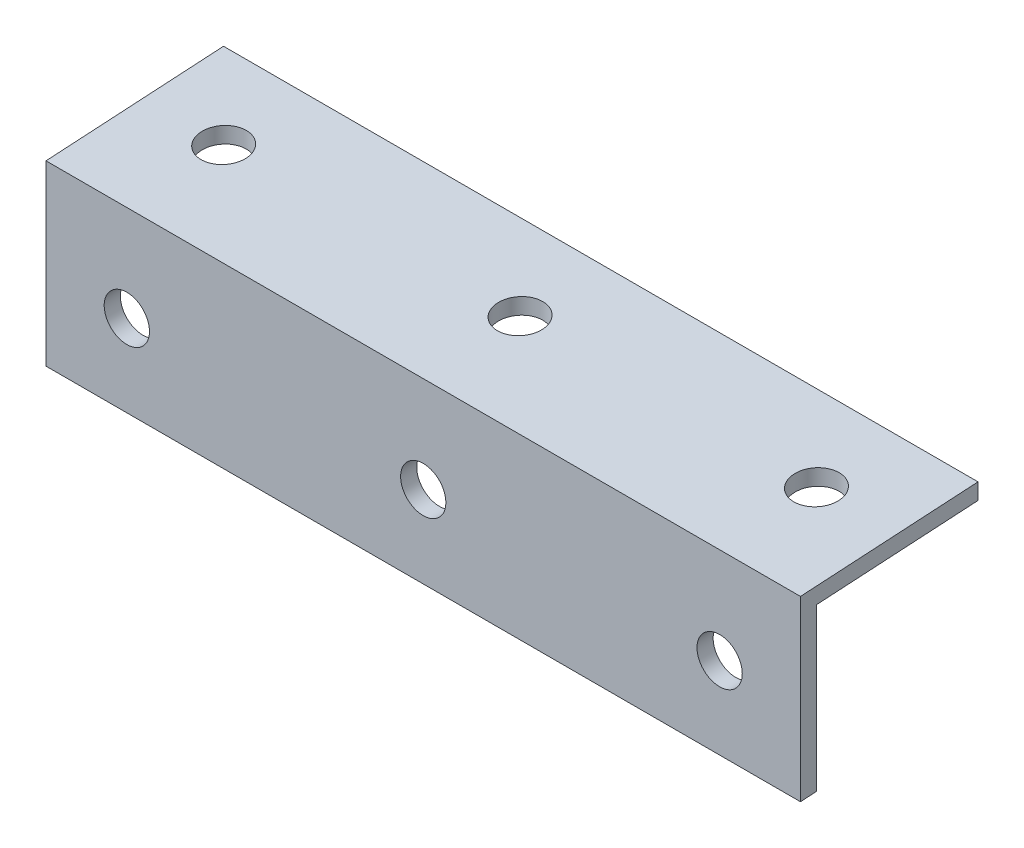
ISO-10303-21;
HEADER;
FILE_DESCRIPTION(('STEP AP214'),'2;1');
FILE_NAME('part.step','',(''),(''),'','','');
FILE_SCHEMA(('AUTOMOTIVE_DESIGN { 1 0 10303 214 1 1 1 1 }'));
ENDSEC;
DATA;
#1=APPLICATION_CONTEXT('core data for automotive mechanical design processes');
#2=APPLICATION_PROTOCOL_DEFINITION('international standard','automotive_design',2000,#1);
#3=PRODUCT_CONTEXT('',#1,'mechanical');
#4=PRODUCT('Part','Part','',(#3));
#5=PRODUCT_RELATED_PRODUCT_CATEGORY('part','',(#4));
#6=PRODUCT_DEFINITION_FORMATION('','',#4);
#7=PRODUCT_DEFINITION_CONTEXT('part definition',#1,'design');
#8=PRODUCT_DEFINITION('design','',#6,#7);
#9=PRODUCT_DEFINITION_SHAPE('','',#8);
#10=(LENGTH_UNIT() NAMED_UNIT(*) SI_UNIT(.MILLI.,.METRE.));
#11=(NAMED_UNIT(*) PLANE_ANGLE_UNIT() SI_UNIT($,.RADIAN.));
#12=(NAMED_UNIT(*) SI_UNIT($,.STERADIAN.) SOLID_ANGLE_UNIT());
#13=UNCERTAINTY_MEASURE_WITH_UNIT(LENGTH_MEASURE(1.E-05),#10,'distance_accuracy_value','');
#14=(GEOMETRIC_REPRESENTATION_CONTEXT(3) GLOBAL_UNCERTAINTY_ASSIGNED_CONTEXT((#13)) GLOBAL_UNIT_ASSIGNED_CONTEXT((#10,
#11,#12)) REPRESENTATION_CONTEXT('',''));
#15=CARTESIAN_POINT('',(0.,0.,0.));
#16=DIRECTION('',(0.,0.,1.));
#17=DIRECTION('',(1.,0.,0.));
#18=AXIS2_PLACEMENT_3D('',#15,#16,#17);
#19=CARTESIAN_POINT('',(88.9000000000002,-19.1620588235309,1.90170129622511));
#20=DIRECTION('',(0.,0.998268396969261,0.0588235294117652));
#21=DIRECTION('',(0.,-0.0588235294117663,0.998268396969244));
#22=AXIS2_PLACEMENT_3D('',#19,#20,#21);
#23=PLANE('',#22);
#24=DIRECTION('',(0.,0.0588235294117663,-0.998268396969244));
#25=VECTOR('',#24,1.);
#26=CARTESIAN_POINT('',(8.88178419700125E-13,-19.1620588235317,1.90170129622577));
#27=LINE('',#26,#25);
#28=CARTESIAN_POINT('',(8.88178419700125E-13,-19.1620588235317,1.90170129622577));
#29=VERTEX_POINT('',#28);
#30=CARTESIAN_POINT('',(4.44089209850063E-13,-19.0500000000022,-8.60422844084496E-13));
#31=VERTEX_POINT('',#30);
#32=EDGE_CURVE('E137',#29,#31,#27,.T.);
#33=ORIENTED_EDGE('',*,*,#32,.T.);
#34=DIRECTION('',(-1.00000000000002,0.,0.));
#35=VECTOR('',#34,1.);
#36=CARTESIAN_POINT('',(88.9,-19.050000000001,-8.32667268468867E-13));
#37=LINE('',#36,#35);
#38=CARTESIAN_POINT('',(88.9,-19.050000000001,-8.32667268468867E-13));
#39=VERTEX_POINT('',#38);
#40=EDGE_CURVE('E11',#39,#31,#37,.T.);
#41=ORIENTED_EDGE('',*,*,#40,.F.);
#42=DIRECTION('',(0.,0.0588235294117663,-0.998268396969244));
#43=VECTOR('',#42,1.);
#44=CARTESIAN_POINT('',(88.9000000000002,-19.1620588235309,1.90170129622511));
#45=LINE('',#44,#43);
#46=CARTESIAN_POINT('',(88.9000000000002,-19.1620588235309,1.90170129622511));
#47=VERTEX_POINT('',#46);
#48=EDGE_CURVE('E156',#47,#39,#45,.T.);
#49=ORIENTED_EDGE('',*,*,#48,.F.);
#50=DIRECTION('',(-1.00000000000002,0.,0.));
#51=VECTOR('',#50,1.);
#52=CARTESIAN_POINT('',(88.9000000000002,-19.1620588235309,1.90170129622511));
#53=LINE('',#52,#51);
#54=EDGE_CURVE('E132',#47,#29,#53,.T.);
#55=ORIENTED_EDGE('',*,*,#54,.T.);
#56=EDGE_LOOP('',(#33,#41,#49,#55));
#57=FACE_BOUND('',#56,.T.);
#58=ADVANCED_FACE('F50',(#57),#23,.F.);
#59=CARTESIAN_POINT('',(88.9,-19.050000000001,-8.32667268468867E-13));
#60=DIRECTION('',(0.,0.,1.));
#61=DIRECTION('',(1.00000000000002,0.,0.));
#62=AXIS2_PLACEMENT_3D('',#59,#60,#61);
#63=PLANE('',#62);
#64=CARTESIAN_POINT('',(9.52499999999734,-9.52500000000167,-3.33066907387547E-13));
#65=DIRECTION('',(0.,0.,1.));
#66=DIRECTION('',(1.00000000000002,0.,0.));
#67=AXIS2_PLACEMENT_3D('',#64,#65,#66);
#68=CIRCLE('',#67,2.667);
#69=CARTESIAN_POINT('',(12.1919999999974,-9.52500000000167,-3.33103590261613E-13));
#70=VERTEX_POINT('',#69);
#71=EDGE_CURVE('E145',#70,#70,#68,.T.);
#72=ORIENTED_EDGE('',*,*,#71,.T.);
#73=EDGE_LOOP('',(#72));
#74=FACE_BOUND('',#73,.T.);
#75=CARTESIAN_POINT('',(44.4499999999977,-9.52500000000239,-2.02615701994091E-12));
#76=DIRECTION('',(0.,0.,1.));
#77=DIRECTION('',(1.00000000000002,0.,0.));
#78=AXIS2_PLACEMENT_3D('',#75,#76,#77);
#79=CIRCLE('',#78,2.667);
#80=CARTESIAN_POINT('',(47.1169999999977,-9.52500000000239,-2.02619370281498E-12));
#81=VERTEX_POINT('',#80);
#82=EDGE_CURVE('E210',#81,#81,#79,.T.);
#83=ORIENTED_EDGE('',*,*,#82,.T.);
#84=EDGE_LOOP('',(#83));
#85=FACE_BOUND('',#84,.T.);
#86=CARTESIAN_POINT('',(79.3749999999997,-9.52500000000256,-6.93889390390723E-13));
#87=DIRECTION('',(0.,0.,1.));
#88=DIRECTION('',(1.00000000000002,0.,0.));
#89=AXIS2_PLACEMENT_3D('',#86,#87,#88);
#90=CIRCLE('',#89,2.667);
#91=CARTESIAN_POINT('',(82.0419999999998,-9.52500000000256,-6.93926073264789E-13));
#92=VERTEX_POINT('',#91);
#93=EDGE_CURVE('E198',#92,#92,#90,.T.);
#94=ORIENTED_EDGE('',*,*,#93,.T.);
#95=EDGE_LOOP('',(#94));
#96=FACE_BOUND('',#95,.T.);
#97=DIRECTION('',(0.,1.00000000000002,0.));
#98=VECTOR('',#97,1.);
#99=CARTESIAN_POINT('',(4.44089209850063E-13,-19.0500000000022,-8.60422844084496E-13));
#100=LINE('',#99,#98);
#101=CARTESIAN_POINT('',(0.,0.,0.));
#102=VERTEX_POINT('',#101);
#103=EDGE_CURVE('E141',#31,#102,#100,.T.);
#104=ORIENTED_EDGE('',*,*,#103,.T.);
#105=DIRECTION('',(-1.00000000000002,0.,0.));
#106=VECTOR('',#105,1.);
#107=CARTESIAN_POINT('',(88.9000000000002,-1.4432899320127E-12,-1.22124532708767E-12));
#108=LINE('',#107,#106);
#109=CARTESIAN_POINT('',(88.9000000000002,-1.4432899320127E-12,-1.22124532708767E-12));
#110=VERTEX_POINT('',#109);
#111=EDGE_CURVE('E60',#110,#102,#108,.T.);
#112=ORIENTED_EDGE('',*,*,#111,.F.);
#113=DIRECTION('',(0.,1.00000000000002,0.));
#114=VECTOR('',#113,1.);
#115=CARTESIAN_POINT('',(88.9,-19.050000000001,-8.32667268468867E-13));
#116=LINE('',#115,#114);
#117=EDGE_CURVE('E103',#39,#110,#116,.T.);
#118=ORIENTED_EDGE('',*,*,#117,.F.);
#119=ORIENTED_EDGE('',*,*,#40,.T.);
#120=EDGE_LOOP('',(#104,#112,#118,#119));
#121=FACE_BOUND('',#120,.T.);
#122=ADVANCED_FACE('F273',(#74,#85,#96,#121),#63,.F.);
#123=CARTESIAN_POINT('',(88.9000000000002,-1.4432899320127E-12,-1.22124532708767E-12));
#124=DIRECTION('',(0.,0.998268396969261,0.0588235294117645));
#125=DIRECTION('',(0.,-0.0588235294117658,0.998268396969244));
#126=AXIS2_PLACEMENT_3D('',#123,#124,#125);
#127=PLANE('',#126);
#128=CARTESIAN_POINT('',(9.52499999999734,0.560294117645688,-9.50850648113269));
#129=DIRECTION('',(0.,0.998268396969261,0.0588235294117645));
#130=DIRECTION('',(0.,0.0588235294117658,-0.998268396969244));
#131=AXIS2_PLACEMENT_3D('',#128,#129,#130);
#132=ELLIPSE('',#131,2.67162619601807,2.667);
#133=CARTESIAN_POINT('',(9.52499999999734,0.717448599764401,-12.1755064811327));
#134=VERTEX_POINT('',#133);
#135=EDGE_CURVE('E186',#134,#134,#132,.T.);
#136=ORIENTED_EDGE('',*,*,#135,.T.);
#137=EDGE_LOOP('',(#136));
#138=FACE_BOUND('',#137,.T.);
#139=CARTESIAN_POINT('',(44.4499999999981,0.560294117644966,-9.50850648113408));
#140=DIRECTION('',(0.,0.998268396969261,0.0588235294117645));
#141=DIRECTION('',(0.,0.0588235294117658,-0.998268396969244));
#142=AXIS2_PLACEMENT_3D('',#139,#140,#141);
#143=ELLIPSE('',#142,2.67162619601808,2.667);
#144=CARTESIAN_POINT('',(44.4499999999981,0.717448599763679,-12.1755064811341));
#145=VERTEX_POINT('',#144);
#146=EDGE_CURVE('E175',#145,#145,#143,.T.);
#147=ORIENTED_EDGE('',*,*,#146,.T.);
#148=EDGE_LOOP('',(#147));
#149=FACE_BOUND('',#148,.T.);
#150=CARTESIAN_POINT('',(79.375,0.560294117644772,-9.50850648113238));
#151=DIRECTION('',(0.,0.998268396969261,0.0588235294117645));
#152=DIRECTION('',(0.,0.0588235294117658,-0.998268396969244));
#153=AXIS2_PLACEMENT_3D('',#150,#151,#152);
#154=ELLIPSE('',#153,2.67162619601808,2.667);
#155=CARTESIAN_POINT('',(79.375,0.717448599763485,-12.1755064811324));
#156=VERTEX_POINT('',#155);
#157=EDGE_CURVE('E166',#156,#156,#154,.T.);
#158=ORIENTED_EDGE('',*,*,#157,.T.);
#159=EDGE_LOOP('',(#158));
#160=FACE_BOUND('',#159,.T.);
#161=DIRECTION('',(0.,0.0588235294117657,-0.998268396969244));
#162=VECTOR('',#161,1.);
#163=CARTESIAN_POINT('',(0.,0.,0.));
#164=LINE('',#163,#162);
#165=CARTESIAN_POINT('',(-1.55431223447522E-12,1.12058823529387,-19.0170129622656));
#166=VERTEX_POINT('',#165);
#167=EDGE_CURVE('E150',#102,#166,#164,.T.);
#168=ORIENTED_EDGE('',*,*,#167,.T.);
#169=DIRECTION('',(-1.00000000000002,0.,0.));
#170=VECTOR('',#169,1.);
#171=CARTESIAN_POINT('',(88.9,1.12058823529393,-19.0170129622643));
#172=LINE('',#171,#170);
#173=CARTESIAN_POINT('',(88.9,1.12058823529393,-19.0170129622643));
#174=VERTEX_POINT('',#173);
#175=EDGE_CURVE('E130',#174,#166,#172,.T.);
#176=ORIENTED_EDGE('',*,*,#175,.F.);
#177=DIRECTION('',(0.,0.0588235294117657,-0.998268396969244));
#178=VECTOR('',#177,1.);
#179=CARTESIAN_POINT('',(88.9000000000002,-1.4432899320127E-12,-1.22124532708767E-12));
#180=LINE('',#179,#178);
#181=EDGE_CURVE('E119',#110,#174,#180,.T.);
#182=ORIENTED_EDGE('',*,*,#181,.F.);
#183=ORIENTED_EDGE('',*,*,#111,.T.);
#184=EDGE_LOOP('',(#168,#176,#182,#183));
#185=FACE_BOUND('',#184,.T.);
#186=ADVANCED_FACE('F271',(#138,#149,#160,#185),#127,.F.);
#187=CARTESIAN_POINT('',(88.9,1.12058823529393,-19.0170129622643));
#188=DIRECTION('',(0.,0.,1.));
#189=DIRECTION('',(1.00000000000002,0.,0.));
#190=AXIS2_PLACEMENT_3D('',#187,#188,#189);
#191=PLANE('',#190);
#192=DIRECTION('',(0.,1.00000000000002,0.));
#193=VECTOR('',#192,1.);
#194=CARTESIAN_POINT('',(-1.55431223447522E-12,1.12058823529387,-19.0170129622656));
#195=LINE('',#194,#193);
#196=CARTESIAN_POINT('',(1.11022302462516E-12,3.02558823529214,-19.017012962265));
#197=VERTEX_POINT('',#196);
#198=EDGE_CURVE('E124',#166,#197,#195,.T.);
#199=ORIENTED_EDGE('',*,*,#198,.T.);
#200=DIRECTION('',(-1.00000000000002,0.,0.));
#201=VECTOR('',#200,1.);
#202=CARTESIAN_POINT('',(88.9000000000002,3.02558823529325,-19.0170129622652));
#203=LINE('',#202,#201);
#204=CARTESIAN_POINT('',(88.9000000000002,3.02558823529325,-19.0170129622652));
#205=VERTEX_POINT('',#204);
#206=EDGE_CURVE('E125',#205,#197,#203,.T.);
#207=ORIENTED_EDGE('',*,*,#206,.F.);
#208=DIRECTION('',(0.,1.00000000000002,0.));
#209=VECTOR('',#208,1.);
#210=CARTESIAN_POINT('',(88.9,1.12058823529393,-19.0170129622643));
#211=LINE('',#210,#209);
#212=EDGE_CURVE('E109',#174,#205,#211,.T.);
#213=ORIENTED_EDGE('',*,*,#212,.F.);
#214=ORIENTED_EDGE('',*,*,#175,.T.);
#215=EDGE_LOOP('',(#199,#207,#213,#214));
#216=FACE_BOUND('',#215,.T.);
#217=ADVANCED_FACE('F123',(#216),#191,.F.);
#218=CARTESIAN_POINT('',(88.9000000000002,3.02558823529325,-19.0170129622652));
#219=DIRECTION('',(0.,-0.998268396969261,-0.0588235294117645));
#220=DIRECTION('',(0.,0.0588235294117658,-0.998268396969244));
#221=AXIS2_PLACEMENT_3D('',#218,#219,#220);
#222=PLANE('',#221);
#223=CARTESIAN_POINT('',(9.52499999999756,2.46529411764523,-9.50850648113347));
#224=DIRECTION('',(0.,-0.998268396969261,-0.0588235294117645));
#225=DIRECTION('',(0.,0.0588235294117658,-0.998268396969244));
#226=AXIS2_PLACEMENT_3D('',#223,#224,#225);
#227=ELLIPSE('',#226,2.67162619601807,2.667);
#228=CARTESIAN_POINT('',(9.52499999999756,2.62244859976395,-12.1755064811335));
#229=VERTEX_POINT('',#228);
#230=EDGE_CURVE('E49',#229,#229,#227,.T.);
#231=ORIENTED_EDGE('',*,*,#230,.T.);
#232=EDGE_LOOP('',(#231));
#233=FACE_BOUND('',#232,.T.);
#234=CARTESIAN_POINT('',(44.4499999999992,2.4652941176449,-9.50850648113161));
#235=DIRECTION('',(0.,-0.998268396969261,-0.0588235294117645));
#236=DIRECTION('',(0.,0.0588235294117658,-0.998268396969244));
#237=AXIS2_PLACEMENT_3D('',#234,#235,#236);
#238=ELLIPSE('',#237,2.67162619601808,2.667);
#239=CARTESIAN_POINT('',(44.4499999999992,2.62244859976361,-12.1755064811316));
#240=VERTEX_POINT('',#239);
#241=EDGE_CURVE('E168',#240,#240,#238,.T.);
#242=ORIENTED_EDGE('',*,*,#241,.T.);
#243=EDGE_LOOP('',(#242));
#244=FACE_BOUND('',#243,.T.);
#245=CARTESIAN_POINT('',(79.3750000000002,2.46529411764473,-9.50850648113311));
#246=DIRECTION('',(0.,-0.998268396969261,-0.0588235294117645));
#247=DIRECTION('',(0.,0.0588235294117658,-0.998268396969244));
#248=AXIS2_PLACEMENT_3D('',#245,#246,#247);
#249=ELLIPSE('',#248,2.67162619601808,2.667);
#250=CARTESIAN_POINT('',(79.3750000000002,2.62244859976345,-12.1755064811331));
#251=VERTEX_POINT('',#250);
#252=EDGE_CURVE('E167',#251,#251,#249,.T.);
#253=ORIENTED_EDGE('',*,*,#252,.T.);
#254=EDGE_LOOP('',(#253));
#255=FACE_BOUND('',#254,.T.);
#256=DIRECTION('',(0.,-0.0588235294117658,0.998268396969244));
#257=VECTOR('',#256,1.);
#258=CARTESIAN_POINT('',(1.11022302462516E-12,3.02558823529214,-19.017012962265));
#259=LINE('',#258,#257);
#260=CARTESIAN_POINT('',(-1.99840144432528E-12,1.79294117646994,1.90170129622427));
#261=VERTEX_POINT('',#260);
#262=EDGE_CURVE('E90',#197,#261,#259,.T.);
#263=ORIENTED_EDGE('',*,*,#262,.T.);
#264=DIRECTION('',(-1.00000000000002,0.,0.));
#265=VECTOR('',#264,1.);
#266=CARTESIAN_POINT('',(88.8999999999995,1.79294117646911,1.90170129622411));
#267=LINE('',#266,#265);
#268=CARTESIAN_POINT('',(88.8999999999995,1.79294117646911,1.90170129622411));
#269=VERTEX_POINT('',#268);
#270=EDGE_CURVE('E126',#269,#261,#267,.T.);
#271=ORIENTED_EDGE('',*,*,#270,.F.);
#272=DIRECTION('',(0.,-0.0588235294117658,0.998268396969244));
#273=VECTOR('',#272,1.);
#274=CARTESIAN_POINT('',(88.9000000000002,3.02558823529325,-19.0170129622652));
#275=LINE('',#274,#273);
#276=EDGE_CURVE('E111',#205,#269,#275,.T.);
#277=ORIENTED_EDGE('',*,*,#276,.F.);
#278=ORIENTED_EDGE('',*,*,#206,.T.);
#279=EDGE_LOOP('',(#263,#271,#277,#278));
#280=FACE_BOUND('',#279,.T.);
#281=ADVANCED_FACE('F128',(#233,#244,#255,#280),#222,.F.);
#282=CARTESIAN_POINT('',(88.8999999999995,1.79294117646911,1.90170129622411));
#283=DIRECTION('',(0.,0.,-1.));
#284=DIRECTION('',(-1.00000000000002,0.,0.));
#285=AXIS2_PLACEMENT_3D('',#282,#283,#284);
#286=PLANE('',#285);
#287=CARTESIAN_POINT('',(9.52500000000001,-9.52500000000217,1.90170129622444));
#288=DIRECTION('',(0.,0.,1.));
#289=DIRECTION('',(1.00000000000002,0.,0.));
#290=AXIS2_PLACEMENT_3D('',#287,#288,#289);
#291=CIRCLE('',#290,2.667);
#292=CARTESIAN_POINT('',(12.1920000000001,-9.52500000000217,1.90170129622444));
#293=VERTEX_POINT('',#292);
#294=EDGE_CURVE('E195',#293,#293,#291,.T.);
#295=ORIENTED_EDGE('',*,*,#294,.F.);
#296=EDGE_LOOP('',(#295));
#297=FACE_BOUND('',#296,.T.);
#298=CARTESIAN_POINT('',(44.4499999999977,-9.5250000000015,1.90170129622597));
#299=DIRECTION('',(0.,0.,1.));
#300=DIRECTION('',(1.00000000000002,0.,0.));
#301=AXIS2_PLACEMENT_3D('',#298,#299,#300);
#302=CIRCLE('',#301,2.667);
#303=CARTESIAN_POINT('',(47.1169999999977,-9.5250000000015,1.90170129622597));
#304=VERTEX_POINT('',#303);
#305=EDGE_CURVE('E197',#304,#304,#302,.T.);
#306=ORIENTED_EDGE('',*,*,#305,.F.);
#307=EDGE_LOOP('',(#306));
#308=FACE_BOUND('',#307,.T.);
#309=CARTESIAN_POINT('',(79.3749999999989,-9.52500000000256,1.90170129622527));
#310=DIRECTION('',(0.,0.,1.));
#311=DIRECTION('',(1.00000000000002,0.,0.));
#312=AXIS2_PLACEMENT_3D('',#309,#310,#311);
#313=CIRCLE('',#312,2.667);
#314=CARTESIAN_POINT('',(82.0419999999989,-9.52500000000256,1.90170129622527));
#315=VERTEX_POINT('',#314);
#316=EDGE_CURVE('E191',#315,#315,#313,.T.);
#317=ORIENTED_EDGE('',*,*,#316,.F.);
#318=EDGE_LOOP('',(#317));
#319=FACE_BOUND('',#318,.T.);
#320=DIRECTION('',(0.,-1.00000000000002,0.));
#321=VECTOR('',#320,1.);
#322=CARTESIAN_POINT('',(-1.99840144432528E-12,1.79294117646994,1.90170129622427));
#323=LINE('',#322,#321);
#324=EDGE_CURVE('E92',#261,#29,#323,.T.);
#325=ORIENTED_EDGE('',*,*,#324,.T.);
#326=ORIENTED_EDGE('',*,*,#54,.F.);
#327=DIRECTION('',(0.,-1.00000000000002,0.));
#328=VECTOR('',#327,1.);
#329=CARTESIAN_POINT('',(88.8999999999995,1.79294117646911,1.90170129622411));
#330=LINE('',#329,#328);
#331=EDGE_CURVE('E66',#269,#47,#330,.T.);
#332=ORIENTED_EDGE('',*,*,#331,.F.);
#333=ORIENTED_EDGE('',*,*,#270,.T.);
#334=EDGE_LOOP('',(#325,#326,#332,#333));
#335=FACE_BOUND('',#334,.T.);
#336=ADVANCED_FACE('F282',(#297,#308,#319,#335),#286,.F.);
#337=CARTESIAN_POINT('',(88.9000000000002,-1.4432899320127E-12,-1.22124532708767E-12));
#338=DIRECTION('',(1.00000000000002,0.,0.));
#339=DIRECTION('',(0.,0.,-1.));
#340=AXIS2_PLACEMENT_3D('',#337,#338,#339);
#341=PLANE('',#340);
#342=ORIENTED_EDGE('',*,*,#48,.T.);
#343=ORIENTED_EDGE('',*,*,#117,.T.);
#344=ORIENTED_EDGE('',*,*,#181,.T.);
#345=ORIENTED_EDGE('',*,*,#212,.T.);
#346=ORIENTED_EDGE('',*,*,#276,.T.);
#347=ORIENTED_EDGE('',*,*,#331,.T.);
#348=EDGE_LOOP('',(#342,#343,#344,#345,#346,#347));
#349=FACE_BOUND('',#348,.T.);
#350=ADVANCED_FACE('F115',(#349),#341,.T.);
#351=CARTESIAN_POINT('',(0.,0.,0.));
#352=DIRECTION('',(1.00000000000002,0.,0.));
#353=DIRECTION('',(0.,0.,-1.));
#354=AXIS2_PLACEMENT_3D('',#351,#352,#353);
#355=PLANE('',#354);
#356=ORIENTED_EDGE('',*,*,#32,.F.);
#357=ORIENTED_EDGE('',*,*,#324,.F.);
#358=ORIENTED_EDGE('',*,*,#262,.F.);
#359=ORIENTED_EDGE('',*,*,#198,.F.);
#360=ORIENTED_EDGE('',*,*,#167,.F.);
#361=ORIENTED_EDGE('',*,*,#103,.F.);
#362=EDGE_LOOP('',(#356,#357,#358,#359,#360,#361));
#363=FACE_BOUND('',#362,.T.);
#364=ADVANCED_FACE('F284',(#363),#355,.F.);
#365=CARTESIAN_POINT('',(79.3750000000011,-9.5250000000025,-19.017012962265));
#366=DIRECTION('',(0.,0.,1.));
#367=DIRECTION('',(1.00000000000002,0.,0.));
#368=AXIS2_PLACEMENT_3D('',#365,#366,#367);
#369=CYLINDRICAL_SURFACE('',#368,2.667);
#370=ORIENTED_EDGE('',*,*,#316,.T.);
#371=EDGE_LOOP('',(#370));
#372=FACE_BOUND('',#371,.T.);
#373=ORIENTED_EDGE('',*,*,#93,.F.);
#374=EDGE_LOOP('',(#373));
#375=FACE_BOUND('',#374,.T.);
#376=ADVANCED_FACE('F332',(#372,#375),#369,.F.);
#377=CARTESIAN_POINT('',(44.4499999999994,-9.52500000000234,-19.0170129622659));
#378=DIRECTION('',(0.,0.,1.));
#379=DIRECTION('',(1.00000000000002,0.,0.));
#380=AXIS2_PLACEMENT_3D('',#377,#378,#379);
#381=CYLINDRICAL_SURFACE('',#380,2.667);
#382=ORIENTED_EDGE('',*,*,#305,.T.);
#383=EDGE_LOOP('',(#382));
#384=FACE_BOUND('',#383,.T.);
#385=ORIENTED_EDGE('',*,*,#82,.F.);
#386=EDGE_LOOP('',(#385));
#387=FACE_BOUND('',#386,.T.);
#388=ADVANCED_FACE('F336',(#384,#387),#381,.F.);
#389=CARTESIAN_POINT('',(9.52499999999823,-9.52500000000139,-19.017012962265));
#390=DIRECTION('',(0.,0.,1.));
#391=DIRECTION('',(1.00000000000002,0.,0.));
#392=AXIS2_PLACEMENT_3D('',#389,#390,#391);
#393=CYLINDRICAL_SURFACE('',#392,2.667);
#394=ORIENTED_EDGE('',*,*,#294,.T.);
#395=EDGE_LOOP('',(#394));
#396=FACE_BOUND('',#395,.T.);
#397=ORIENTED_EDGE('',*,*,#71,.F.);
#398=EDGE_LOOP('',(#397));
#399=FACE_BOUND('',#398,.T.);
#400=ADVANCED_FACE('F344',(#396,#399),#393,.F.);
#401=CARTESIAN_POINT('',(79.3749999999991,-19.1620588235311,-9.5085064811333));
#402=DIRECTION('',(0.,1.00000000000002,0.));
#403=DIRECTION('',(0.,0.,1.));
#404=AXIS2_PLACEMENT_3D('',#401,#402,#403);
#405=CYLINDRICAL_SURFACE('',#404,2.667);
#406=ORIENTED_EDGE('',*,*,#252,.F.);
#407=EDGE_LOOP('',(#406));
#408=FACE_BOUND('',#407,.T.);
#409=ORIENTED_EDGE('',*,*,#157,.F.);
#410=EDGE_LOOP('',(#409));
#411=FACE_BOUND('',#410,.T.);
#412=ADVANCED_FACE('F355',(#408,#411),#405,.F.);
#413=CARTESIAN_POINT('',(44.4499999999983,-19.1620588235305,-9.50850648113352));
#414=DIRECTION('',(0.,1.00000000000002,0.));
#415=DIRECTION('',(0.,0.,1.));
#416=AXIS2_PLACEMENT_3D('',#413,#414,#415);
#417=CYLINDRICAL_SURFACE('',#416,2.667);
#418=ORIENTED_EDGE('',*,*,#241,.F.);
#419=EDGE_LOOP('',(#418));
#420=FACE_BOUND('',#419,.T.);
#421=ORIENTED_EDGE('',*,*,#146,.F.);
#422=EDGE_LOOP('',(#421));
#423=FACE_BOUND('',#422,.T.);
#424=ADVANCED_FACE('F270',(#420,#423),#417,.F.);
#425=CARTESIAN_POINT('',(9.52499999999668,-19.1620588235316,-9.50850648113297));
#426=DIRECTION('',(0.,1.00000000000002,0.));
#427=DIRECTION('',(0.,0.,1.));
#428=AXIS2_PLACEMENT_3D('',#425,#426,#427);
#429=CYLINDRICAL_SURFACE('',#428,2.667);
#430=ORIENTED_EDGE('',*,*,#230,.F.);
#431=EDGE_LOOP('',(#430));
#432=FACE_BOUND('',#431,.T.);
#433=ORIENTED_EDGE('',*,*,#135,.F.);
#434=EDGE_LOOP('',(#433));
#435=FACE_BOUND('',#434,.T.);
#436=ADVANCED_FACE('F262',(#432,#435),#429,.F.);
#437=CLOSED_SHELL('',(#58,#122,#186,#217,#281,#336,#350,#364,#376,#388,#400,#412,#424,#436));
#438=MANIFOLD_SOLID_BREP('B2',#437);
#439=ADVANCED_BREP_SHAPE_REPRESENTATION('',(#18,#438),#14);
#440=SHAPE_DEFINITION_REPRESENTATION(#9,#439);
ENDSEC;
END-ISO-10303-21;
